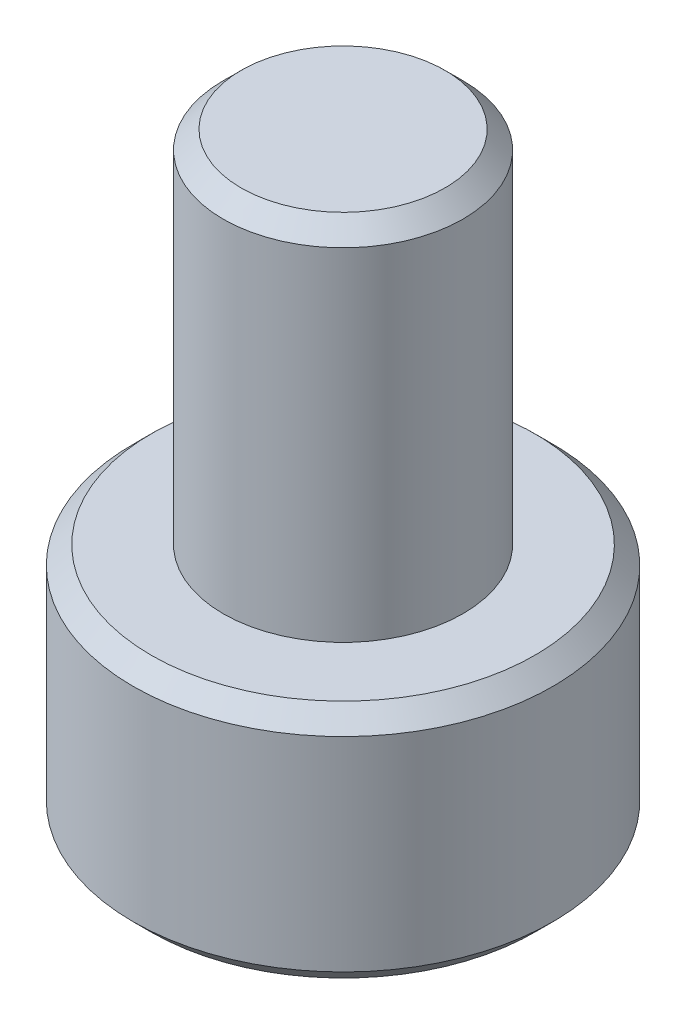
ISO-10303-21;
HEADER;
FILE_DESCRIPTION(('STEP AP214'),'2;1');
FILE_NAME('part.step','',(''),(''),'','','');
FILE_SCHEMA(('AUTOMOTIVE_DESIGN { 1 0 10303 214 1 1 1 1 }'));
ENDSEC;
DATA;
#1=APPLICATION_CONTEXT('core data for automotive mechanical design processes');
#2=APPLICATION_PROTOCOL_DEFINITION('international standard','automotive_design',2000,#1);
#3=PRODUCT_CONTEXT('',#1,'mechanical');
#4=PRODUCT('Part','Part','',(#3));
#5=PRODUCT_RELATED_PRODUCT_CATEGORY('part','',(#4));
#6=PRODUCT_DEFINITION_FORMATION('','',#4);
#7=PRODUCT_DEFINITION_CONTEXT('part definition',#1,'design');
#8=PRODUCT_DEFINITION('design','',#6,#7);
#9=PRODUCT_DEFINITION_SHAPE('','',#8);
#10=(LENGTH_UNIT() NAMED_UNIT(*) SI_UNIT(.MILLI.,.METRE.));
#11=(NAMED_UNIT(*) PLANE_ANGLE_UNIT() SI_UNIT($,.RADIAN.));
#12=(NAMED_UNIT(*) SI_UNIT($,.STERADIAN.) SOLID_ANGLE_UNIT());
#13=UNCERTAINTY_MEASURE_WITH_UNIT(LENGTH_MEASURE(1.E-05),#10,'distance_accuracy_value','');
#14=(GEOMETRIC_REPRESENTATION_CONTEXT(3) GLOBAL_UNCERTAINTY_ASSIGNED_CONTEXT((#13)) GLOBAL_UNIT_ASSIGNED_CONTEXT((#10,
#11,#12)) REPRESENTATION_CONTEXT('',''));
#15=CARTESIAN_POINT('',(0.,0.,0.));
#16=DIRECTION('',(0.,0.,1.));
#17=DIRECTION('',(1.,0.,0.));
#18=AXIS2_PLACEMENT_3D('',#15,#16,#17);
#19=CARTESIAN_POINT('',(0.,4.,0.));
#20=DIRECTION('',(0.,1.,0.));
#21=DIRECTION('',(0.,0.,1.));
#22=AXIS2_PLACEMENT_3D('',#19,#20,#21);
#23=PLANE('',#22);
#24=CARTESIAN_POINT('',(0.,4.,0.));
#25=DIRECTION('',(0.,1.,0.));
#26=DIRECTION('',(0.,0.,1.));
#27=AXIS2_PLACEMENT_3D('',#24,#25,#26);
#28=CIRCLE('',#27,3.2);
#29=CARTESIAN_POINT('',(0.,4.,3.2));
#30=VERTEX_POINT('',#29);
#31=EDGE_CURVE('E154',#30,#30,#28,.T.);
#32=ORIENTED_EDGE('',*,*,#31,.T.);
#33=EDGE_LOOP('',(#32));
#34=FACE_BOUND('',#33,.T.);
#35=CARTESIAN_POINT('',(0.,4.,0.));
#36=DIRECTION('',(0.,1.,0.));
#37=DIRECTION('',(0.,0.,1.));
#38=AXIS2_PLACEMENT_3D('',#35,#36,#37);
#39=CIRCLE('',#38,2.);
#40=CARTESIAN_POINT('',(0.,4.,2.));
#41=VERTEX_POINT('',#40);
#42=EDGE_CURVE('E137',#41,#41,#39,.T.);
#43=ORIENTED_EDGE('',*,*,#42,.F.);
#44=EDGE_LOOP('',(#43));
#45=FACE_BOUND('',#44,.T.);
#46=ADVANCED_FACE('F35',(#34,#45),#23,.T.);
#47=CARTESIAN_POINT('',(0.,4.,0.));
#48=DIRECTION('',(0.,-1.,0.));
#49=DIRECTION('',(0.,0.,-1.));
#50=AXIS2_PLACEMENT_3D('',#47,#48,#49);
#51=CYLINDRICAL_SURFACE('',#50,3.5);
#52=CARTESIAN_POINT('',(0.,0.299999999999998,0.));
#53=DIRECTION('',(0.,1.,0.));
#54=DIRECTION('',(0.,0.,1.));
#55=AXIS2_PLACEMENT_3D('',#52,#53,#54);
#56=CIRCLE('',#55,3.5);
#57=CARTESIAN_POINT('',(0.,0.299999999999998,3.5));
#58=VERTEX_POINT('',#57);
#59=EDGE_CURVE('E148',#58,#58,#56,.T.);
#60=ORIENTED_EDGE('',*,*,#59,.T.);
#61=EDGE_LOOP('',(#60));
#62=FACE_BOUND('',#61,.T.);
#63=CARTESIAN_POINT('',(0.,3.7,0.));
#64=DIRECTION('',(0.,1.,0.));
#65=DIRECTION('',(0.,0.,1.));
#66=AXIS2_PLACEMENT_3D('',#63,#64,#65);
#67=CIRCLE('',#66,3.5);
#68=CARTESIAN_POINT('',(0.,3.7,3.5));
#69=VERTEX_POINT('',#68);
#70=EDGE_CURVE('E145',#69,#69,#67,.F.);
#71=ORIENTED_EDGE('',*,*,#70,.T.);
#72=EDGE_LOOP('',(#71));
#73=FACE_BOUND('',#72,.T.);
#74=ADVANCED_FACE('F175',(#62,#73),#51,.T.);
#75=CARTESIAN_POINT('',(0.,0.,0.));
#76=DIRECTION('',(0.,1.,0.));
#77=DIRECTION('',(0.,0.,1.));
#78=AXIS2_PLACEMENT_3D('',#75,#76,#77);
#79=PLANE('',#78);
#80=DIRECTION('',(-0.5,0.,0.866025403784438));
#81=VECTOR('',#80,1.);
#82=CARTESIAN_POINT('',(1.77246532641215,0.,0.));
#83=LINE('',#82,#81);
#84=CARTESIAN_POINT('',(1.77246532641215,0.,0.));
#85=VERTEX_POINT('',#84);
#86=CARTESIAN_POINT('',(0.886232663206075,0.,1.535));
#87=VERTEX_POINT('',#86);
#88=EDGE_CURVE('E124',#85,#87,#83,.T.);
#89=ORIENTED_EDGE('',*,*,#88,.F.);
#90=DIRECTION('',(0.5,0.,0.866025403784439));
#91=VECTOR('',#90,1.);
#92=CARTESIAN_POINT('',(0.886232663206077,0.,-1.535));
#93=LINE('',#92,#91);
#94=CARTESIAN_POINT('',(0.886232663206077,0.,-1.535));
#95=VERTEX_POINT('',#94);
#96=EDGE_CURVE('E50',#95,#85,#93,.T.);
#97=ORIENTED_EDGE('',*,*,#96,.F.);
#98=DIRECTION('',(1.,0.,0.));
#99=VECTOR('',#98,1.);
#100=CARTESIAN_POINT('',(-0.886232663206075,0.,-1.535));
#101=LINE('',#100,#99);
#102=CARTESIAN_POINT('',(-0.886232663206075,0.,-1.535));
#103=VERTEX_POINT('',#102);
#104=EDGE_CURVE('E133',#103,#95,#101,.T.);
#105=ORIENTED_EDGE('',*,*,#104,.F.);
#106=DIRECTION('',(0.5,0.,-0.866025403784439));
#107=VECTOR('',#106,1.);
#108=CARTESIAN_POINT('',(-1.77246532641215,0.,0.));
#109=LINE('',#108,#107);
#110=CARTESIAN_POINT('',(-1.77246532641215,0.,0.));
#111=VERTEX_POINT('',#110);
#112=EDGE_CURVE('E131',#111,#103,#109,.T.);
#113=ORIENTED_EDGE('',*,*,#112,.F.);
#114=DIRECTION('',(-0.5,0.,-0.866025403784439));
#115=VECTOR('',#114,1.);
#116=CARTESIAN_POINT('',(-0.886232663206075,0.,1.535));
#117=LINE('',#116,#115);
#118=CARTESIAN_POINT('',(-0.886232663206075,0.,1.535));
#119=VERTEX_POINT('',#118);
#120=EDGE_CURVE('E98',#119,#111,#117,.T.);
#121=ORIENTED_EDGE('',*,*,#120,.F.);
#122=DIRECTION('',(-1.,0.,0.));
#123=VECTOR('',#122,1.);
#124=CARTESIAN_POINT('',(0.886232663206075,0.,1.535));
#125=LINE('',#124,#123);
#126=EDGE_CURVE('E127',#87,#119,#125,.T.);
#127=ORIENTED_EDGE('',*,*,#126,.F.);
#128=EDGE_LOOP('',(#89,#97,#105,#113,#121,#127));
#129=FACE_BOUND('',#128,.T.);
#130=CARTESIAN_POINT('',(0.,0.,0.));
#131=DIRECTION('',(0.,1.,0.));
#132=DIRECTION('',(0.,0.,1.));
#133=AXIS2_PLACEMENT_3D('',#130,#131,#132);
#134=CIRCLE('',#133,3.2);
#135=CARTESIAN_POINT('',(0.,0.,3.2));
#136=VERTEX_POINT('',#135);
#137=EDGE_CURVE('E151',#136,#136,#134,.F.);
#138=ORIENTED_EDGE('',*,*,#137,.T.);
#139=EDGE_LOOP('',(#138));
#140=FACE_BOUND('',#139,.T.);
#141=ADVANCED_FACE('F181',(#129,#140),#79,.F.);
#142=CARTESIAN_POINT('',(0.,10.,0.));
#143=DIRECTION('',(0.,-1.,0.));
#144=DIRECTION('',(0.,0.,-1.));
#145=AXIS2_PLACEMENT_3D('',#142,#143,#144);
#146=CYLINDRICAL_SURFACE('',#145,2.);
#147=CARTESIAN_POINT('',(0.,9.7,0.));
#148=DIRECTION('',(0.,1.,0.));
#149=DIRECTION('',(0.,0.,1.));
#150=AXIS2_PLACEMENT_3D('',#147,#148,#149);
#151=CIRCLE('',#150,2.);
#152=CARTESIAN_POINT('',(0.,9.7,2.));
#153=VERTEX_POINT('',#152);
#154=EDGE_CURVE('E11',#153,#153,#151,.F.);
#155=ORIENTED_EDGE('',*,*,#154,.T.);
#156=EDGE_LOOP('',(#155));
#157=FACE_BOUND('',#156,.T.);
#158=ORIENTED_EDGE('',*,*,#42,.T.);
#159=EDGE_LOOP('',(#158));
#160=FACE_BOUND('',#159,.T.);
#161=ADVANCED_FACE('F187',(#157,#160),#146,.T.);
#162=CARTESIAN_POINT('',(0.,10.,0.));
#163=DIRECTION('',(0.,1.,0.));
#164=DIRECTION('',(0.,0.,1.));
#165=AXIS2_PLACEMENT_3D('',#162,#163,#164);
#166=PLANE('',#165);
#167=CARTESIAN_POINT('',(0.,10.,0.));
#168=DIRECTION('',(0.,1.,0.));
#169=DIRECTION('',(0.,0.,1.));
#170=AXIS2_PLACEMENT_3D('',#167,#168,#169);
#171=CIRCLE('',#170,1.7);
#172=CARTESIAN_POINT('',(0.,10.,1.7));
#173=VERTEX_POINT('',#172);
#174=EDGE_CURVE('E43',#173,#173,#171,.T.);
#175=ORIENTED_EDGE('',*,*,#174,.T.);
#176=EDGE_LOOP('',(#175));
#177=FACE_BOUND('',#176,.T.);
#178=ADVANCED_FACE('F159',(#177),#166,.T.);
#179=CARTESIAN_POINT('',(0.,0.299999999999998,0.));
#180=DIRECTION('',(0.,1.,0.));
#181=DIRECTION('',(0.,0.,1.));
#182=AXIS2_PLACEMENT_3D('',#179,#180,#181);
#183=CONICAL_SURFACE('',#182,3.5,0.785398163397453);
#184=ORIENTED_EDGE('',*,*,#137,.F.);
#185=EDGE_LOOP('',(#184));
#186=FACE_BOUND('',#185,.T.);
#187=ORIENTED_EDGE('',*,*,#59,.F.);
#188=EDGE_LOOP('',(#187));
#189=FACE_BOUND('',#188,.T.);
#190=ADVANCED_FACE('F171',(#186,#189),#183,.T.);
#191=CARTESIAN_POINT('',(0.,4.,0.));
#192=DIRECTION('',(0.,-1.,0.));
#193=DIRECTION('',(0.,0.,-1.));
#194=AXIS2_PLACEMENT_3D('',#191,#192,#193);
#195=CONICAL_SURFACE('',#194,3.2,0.785398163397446);
#196=ORIENTED_EDGE('',*,*,#70,.F.);
#197=EDGE_LOOP('',(#196));
#198=FACE_BOUND('',#197,.T.);
#199=ORIENTED_EDGE('',*,*,#31,.F.);
#200=EDGE_LOOP('',(#199));
#201=FACE_BOUND('',#200,.T.);
#202=ADVANCED_FACE('F163',(#198,#201),#195,.T.);
#203=CARTESIAN_POINT('',(0.,10.,0.));
#204=DIRECTION('',(0.,-1.,0.));
#205=DIRECTION('',(0.,0.,-1.));
#206=AXIS2_PLACEMENT_3D('',#203,#204,#205);
#207=CONICAL_SURFACE('',#206,1.7,0.785398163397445);
#208=ORIENTED_EDGE('',*,*,#154,.F.);
#209=EDGE_LOOP('',(#208));
#210=FACE_BOUND('',#209,.T.);
#211=ORIENTED_EDGE('',*,*,#174,.F.);
#212=EDGE_LOOP('',(#211));
#213=FACE_BOUND('',#212,.T.);
#214=ADVANCED_FACE('F37',(#210,#213),#207,.T.);
#215=CARTESIAN_POINT('',(0.886232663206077,2.,-1.535));
#216=DIRECTION('',(0.866025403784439,0.,-0.5));
#217=DIRECTION('',(-0.5,0.,-0.866025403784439));
#218=AXIS2_PLACEMENT_3D('',#215,#216,#217);
#219=PLANE('',#218);
#220=ORIENTED_EDGE('',*,*,#96,.T.);
#221=DIRECTION('',(0.,-1.,0.));
#222=VECTOR('',#221,1.);
#223=CARTESIAN_POINT('',(1.77246532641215,2.,0.));
#224=LINE('',#223,#222);
#225=CARTESIAN_POINT('',(1.77246532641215,2.,0.));
#226=VERTEX_POINT('',#225);
#227=EDGE_CURVE('E80',#226,#85,#224,.T.);
#228=ORIENTED_EDGE('',*,*,#227,.F.);
#229=DIRECTION('',(0.5,0.,0.866025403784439));
#230=VECTOR('',#229,1.);
#231=CARTESIAN_POINT('',(0.886232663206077,2.,-1.535));
#232=LINE('',#231,#230);
#233=CARTESIAN_POINT('',(0.886232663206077,2.,-1.535));
#234=VERTEX_POINT('',#233);
#235=EDGE_CURVE('E135',#234,#226,#232,.T.);
#236=ORIENTED_EDGE('',*,*,#235,.F.);
#237=DIRECTION('',(0.,-1.,0.));
#238=VECTOR('',#237,1.);
#239=CARTESIAN_POINT('',(0.886232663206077,2.,-1.535));
#240=LINE('',#239,#238);
#241=EDGE_CURVE('E58',#234,#95,#240,.T.);
#242=ORIENTED_EDGE('',*,*,#241,.T.);
#243=EDGE_LOOP('',(#220,#228,#236,#242));
#244=FACE_BOUND('',#243,.T.);
#245=ADVANCED_FACE('F162',(#244),#219,.F.);
#246=CARTESIAN_POINT('',(-0.886232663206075,2.,-1.535));
#247=DIRECTION('',(0.,0.,-1.));
#248=DIRECTION('',(-1.,0.,0.));
#249=AXIS2_PLACEMENT_3D('',#246,#247,#248);
#250=PLANE('',#249);
#251=ORIENTED_EDGE('',*,*,#104,.T.);
#252=ORIENTED_EDGE('',*,*,#241,.F.);
#253=DIRECTION('',(1.,0.,0.));
#254=VECTOR('',#253,1.);
#255=CARTESIAN_POINT('',(-0.886232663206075,2.,-1.535));
#256=LINE('',#255,#254);
#257=CARTESIAN_POINT('',(-0.886232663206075,2.,-1.535));
#258=VERTEX_POINT('',#257);
#259=EDGE_CURVE('E110',#258,#234,#256,.T.);
#260=ORIENTED_EDGE('',*,*,#259,.F.);
#261=DIRECTION('',(0.,-1.,0.));
#262=VECTOR('',#261,1.);
#263=CARTESIAN_POINT('',(-0.886232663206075,2.,-1.535));
#264=LINE('',#263,#262);
#265=EDGE_CURVE('E102',#258,#103,#264,.T.);
#266=ORIENTED_EDGE('',*,*,#265,.T.);
#267=EDGE_LOOP('',(#251,#252,#260,#266));
#268=FACE_BOUND('',#267,.T.);
#269=ADVANCED_FACE('F169',(#268),#250,.F.);
#270=CARTESIAN_POINT('',(-1.77246532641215,2.,0.));
#271=DIRECTION('',(-0.866025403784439,0.,-0.5));
#272=DIRECTION('',(-0.5,0.,0.866025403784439));
#273=AXIS2_PLACEMENT_3D('',#270,#271,#272);
#274=PLANE('',#273);
#275=ORIENTED_EDGE('',*,*,#112,.T.);
#276=ORIENTED_EDGE('',*,*,#265,.F.);
#277=DIRECTION('',(0.5,0.,-0.866025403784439));
#278=VECTOR('',#277,1.);
#279=CARTESIAN_POINT('',(-1.77246532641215,2.,0.));
#280=LINE('',#279,#278);
#281=CARTESIAN_POINT('',(-1.77246532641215,2.,0.));
#282=VERTEX_POINT('',#281);
#283=EDGE_CURVE('E106',#282,#258,#280,.T.);
#284=ORIENTED_EDGE('',*,*,#283,.F.);
#285=DIRECTION('',(0.,-1.,0.));
#286=VECTOR('',#285,1.);
#287=CARTESIAN_POINT('',(-1.77246532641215,2.,0.));
#288=LINE('',#287,#286);
#289=EDGE_CURVE('E91',#282,#111,#288,.T.);
#290=ORIENTED_EDGE('',*,*,#289,.T.);
#291=EDGE_LOOP('',(#275,#276,#284,#290));
#292=FACE_BOUND('',#291,.T.);
#293=ADVANCED_FACE('F107',(#292),#274,.F.);
#294=CARTESIAN_POINT('',(-0.886232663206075,2.,1.535));
#295=DIRECTION('',(-0.866025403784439,0.,0.5));
#296=DIRECTION('',(0.5,0.,0.866025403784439));
#297=AXIS2_PLACEMENT_3D('',#294,#295,#296);
#298=PLANE('',#297);
#299=ORIENTED_EDGE('',*,*,#120,.T.);
#300=ORIENTED_EDGE('',*,*,#289,.F.);
#301=DIRECTION('',(-0.5,0.,-0.866025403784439));
#302=VECTOR('',#301,1.);
#303=CARTESIAN_POINT('',(-0.886232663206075,2.,1.535));
#304=LINE('',#303,#302);
#305=CARTESIAN_POINT('',(-0.886232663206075,2.,1.535));
#306=VERTEX_POINT('',#305);
#307=EDGE_CURVE('E95',#306,#282,#304,.T.);
#308=ORIENTED_EDGE('',*,*,#307,.F.);
#309=DIRECTION('',(0.,-1.,0.));
#310=VECTOR('',#309,1.);
#311=CARTESIAN_POINT('',(-0.886232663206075,2.,1.535));
#312=LINE('',#311,#310);
#313=EDGE_CURVE('E103',#306,#119,#312,.T.);
#314=ORIENTED_EDGE('',*,*,#313,.T.);
#315=EDGE_LOOP('',(#299,#300,#308,#314));
#316=FACE_BOUND('',#315,.T.);
#317=ADVANCED_FACE('F93',(#316),#298,.F.);
#318=CARTESIAN_POINT('',(0.886232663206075,2.,1.535));
#319=DIRECTION('',(0.,0.,1.));
#320=DIRECTION('',(1.,0.,0.));
#321=AXIS2_PLACEMENT_3D('',#318,#319,#320);
#322=PLANE('',#321);
#323=ORIENTED_EDGE('',*,*,#126,.T.);
#324=ORIENTED_EDGE('',*,*,#313,.F.);
#325=DIRECTION('',(-1.,0.,0.));
#326=VECTOR('',#325,1.);
#327=CARTESIAN_POINT('',(0.886232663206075,2.,1.535));
#328=LINE('',#327,#326);
#329=CARTESIAN_POINT('',(0.886232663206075,2.,1.535));
#330=VERTEX_POINT('',#329);
#331=EDGE_CURVE('E116',#330,#306,#328,.T.);
#332=ORIENTED_EDGE('',*,*,#331,.F.);
#333=DIRECTION('',(0.,-1.,0.));
#334=VECTOR('',#333,1.);
#335=CARTESIAN_POINT('',(0.886232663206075,2.,1.535));
#336=LINE('',#335,#334);
#337=EDGE_CURVE('E140',#330,#87,#336,.T.);
#338=ORIENTED_EDGE('',*,*,#337,.T.);
#339=EDGE_LOOP('',(#323,#324,#332,#338));
#340=FACE_BOUND('',#339,.T.);
#341=ADVANCED_FACE('F213',(#340),#322,.F.);
#342=CARTESIAN_POINT('',(1.77246532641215,2.,0.));
#343=DIRECTION('',(0.866025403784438,0.,0.5));
#344=DIRECTION('',(0.5,0.,-0.866025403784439));
#345=AXIS2_PLACEMENT_3D('',#342,#343,#344);
#346=PLANE('',#345);
#347=ORIENTED_EDGE('',*,*,#88,.T.);
#348=ORIENTED_EDGE('',*,*,#337,.F.);
#349=DIRECTION('',(-0.5,0.,0.866025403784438));
#350=VECTOR('',#349,1.);
#351=CARTESIAN_POINT('',(1.77246532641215,2.,0.));
#352=LINE('',#351,#350);
#353=EDGE_CURVE('E118',#226,#330,#352,.T.);
#354=ORIENTED_EDGE('',*,*,#353,.F.);
#355=ORIENTED_EDGE('',*,*,#227,.T.);
#356=EDGE_LOOP('',(#347,#348,#354,#355));
#357=FACE_BOUND('',#356,.T.);
#358=ADVANCED_FACE('F210',(#357),#346,.F.);
#359=CARTESIAN_POINT('',(1.77246532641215,2.,0.));
#360=DIRECTION('',(0.,-1.,0.));
#361=DIRECTION('',(0.,0.,-1.));
#362=AXIS2_PLACEMENT_3D('',#359,#360,#361);
#363=PLANE('',#362);
#364=ORIENTED_EDGE('',*,*,#235,.T.);
#365=ORIENTED_EDGE('',*,*,#353,.T.);
#366=ORIENTED_EDGE('',*,*,#331,.T.);
#367=ORIENTED_EDGE('',*,*,#307,.T.);
#368=ORIENTED_EDGE('',*,*,#283,.T.);
#369=ORIENTED_EDGE('',*,*,#259,.T.);
#370=EDGE_LOOP('',(#364,#365,#366,#367,#368,#369));
#371=FACE_BOUND('',#370,.T.);
#372=ADVANCED_FACE('F113',(#371),#363,.T.);
#373=CLOSED_SHELL('',(#46,#74,#141,#161,#178,#190,#202,#214,#245,#269,#293,#317,#341,#358,#372));
#374=MANIFOLD_SOLID_BREP('B2',#373);
#375=ADVANCED_BREP_SHAPE_REPRESENTATION('',(#18,#374),#14);
#376=SHAPE_DEFINITION_REPRESENTATION(#9,#375);
ENDSEC;
END-ISO-10303-21;
